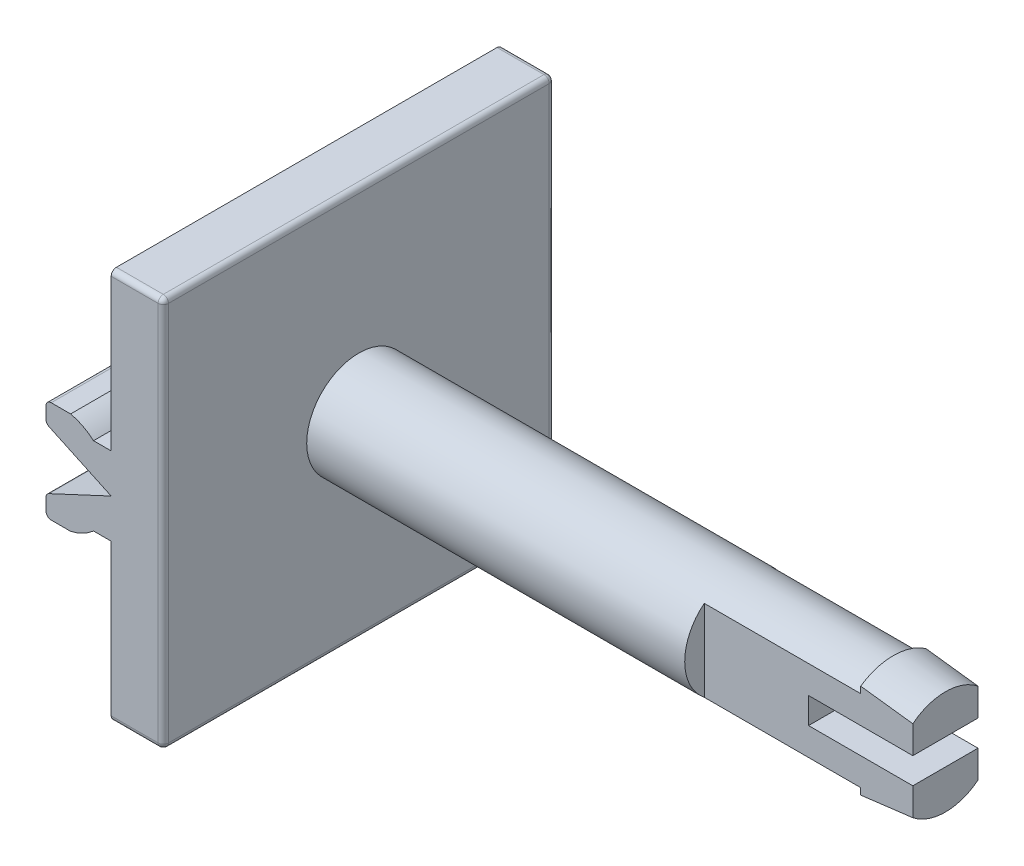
ISO-10303-21;
HEADER;
FILE_DESCRIPTION(('STEP AP214'),'2;1');
FILE_NAME('part.step','',(''),(''),'','','');
FILE_SCHEMA(('AUTOMOTIVE_DESIGN { 1 0 10303 214 1 1 1 1 }'));
ENDSEC;
DATA;
#1=APPLICATION_CONTEXT('core data for automotive mechanical design processes');
#2=APPLICATION_PROTOCOL_DEFINITION('international standard','automotive_design',2000,#1);
#3=PRODUCT_CONTEXT('',#1,'mechanical');
#4=PRODUCT('Part','Part','',(#3));
#5=PRODUCT_RELATED_PRODUCT_CATEGORY('part','',(#4));
#6=PRODUCT_DEFINITION_FORMATION('','',#4);
#7=PRODUCT_DEFINITION_CONTEXT('part definition',#1,'design');
#8=PRODUCT_DEFINITION('design','',#6,#7);
#9=PRODUCT_DEFINITION_SHAPE('','',#8);
#10=(LENGTH_UNIT() NAMED_UNIT(*) SI_UNIT(.MILLI.,.METRE.));
#11=(NAMED_UNIT(*) PLANE_ANGLE_UNIT() SI_UNIT($,.RADIAN.));
#12=(NAMED_UNIT(*) SI_UNIT($,.STERADIAN.) SOLID_ANGLE_UNIT());
#13=UNCERTAINTY_MEASURE_WITH_UNIT(LENGTH_MEASURE(1.E-05),#10,'distance_accuracy_value','');
#14=(GEOMETRIC_REPRESENTATION_CONTEXT(3) GLOBAL_UNCERTAINTY_ASSIGNED_CONTEXT((#13)) GLOBAL_UNIT_ASSIGNED_CONTEXT((#10,
#11,#12)) REPRESENTATION_CONTEXT('',''));
#15=CARTESIAN_POINT('',(0.,0.,0.));
#16=DIRECTION('',(0.,0.,1.));
#17=DIRECTION('',(1.,0.,0.));
#18=AXIS2_PLACEMENT_3D('',#15,#16,#17);
#19=CARTESIAN_POINT('',(24.5,0.,0.));
#20=DIRECTION('',(1.,0.,0.));
#21=DIRECTION('',(0.,0.,-1.));
#22=AXIS2_PLACEMENT_3D('',#19,#20,#21);
#23=PLANE('',#22);
#24=DIRECTION('',(0.,0.,1.));
#25=VECTOR('',#24,1.);
#26=CARTESIAN_POINT('',(24.5,-0.5,-5.37310562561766));
#27=LINE('',#26,#25);
#28=CARTESIAN_POINT('',(24.5,-0.5,-1.25));
#29=VERTEX_POINT('',#28);
#30=CARTESIAN_POINT('',(24.5,-0.5,1.25));
#31=VERTEX_POINT('',#30);
#32=EDGE_CURVE('E777',#29,#31,#27,.T.);
#33=ORIENTED_EDGE('',*,*,#32,.T.);
#34=DIRECTION('',(0.,1.,0.));
#35=VECTOR('',#34,1.);
#36=CARTESIAN_POINT('',(24.5,0.,1.25));
#37=LINE('',#36,#35);
#38=CARTESIAN_POINT('',(24.5,-1.5612494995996,1.25));
#39=VERTEX_POINT('',#38);
#40=EDGE_CURVE('E307',#39,#31,#37,.T.);
#41=ORIENTED_EDGE('',*,*,#40,.F.);
#42=CARTESIAN_POINT('',(24.5,0.,0.));
#43=DIRECTION('',(1.,0.,0.));
#44=DIRECTION('',(0.,0.,-1.));
#45=AXIS2_PLACEMENT_3D('',#42,#43,#44);
#46=CIRCLE('',#45,2.);
#47=CARTESIAN_POINT('',(24.5,-1.5612494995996,-1.25));
#48=VERTEX_POINT('',#47);
#49=EDGE_CURVE('E698',#39,#48,#46,.T.);
#50=ORIENTED_EDGE('',*,*,#49,.T.);
#51=DIRECTION('',(0.,-1.,0.));
#52=VECTOR('',#51,1.);
#53=CARTESIAN_POINT('',(24.5,0.,-1.25));
#54=LINE('',#53,#52);
#55=EDGE_CURVE('E318',#29,#48,#54,.T.);
#56=ORIENTED_EDGE('',*,*,#55,.F.);
#57=EDGE_LOOP('',(#33,#41,#50,#56));
#58=FACE_BOUND('',#57,.T.);
#59=ADVANCED_FACE('F36',(#58),#23,.T.);
#60=CARTESIAN_POINT('',(22.5,0.,0.));
#61=DIRECTION('',(-1.,0.,0.));
#62=DIRECTION('',(0.,0.,1.));
#63=AXIS2_PLACEMENT_3D('',#60,#61,#62);
#64=PLANE('',#63);
#65=DIRECTION('',(0.,1.,0.));
#66=VECTOR('',#65,1.);
#67=CARTESIAN_POINT('',(22.5,0.,-1.25));
#68=LINE('',#67,#66);
#69=CARTESIAN_POINT('',(22.5,-1.81038669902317,-1.25));
#70=VERTEX_POINT('',#69);
#71=CARTESIAN_POINT('',(22.5,-1.5612494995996,-1.25));
#72=VERTEX_POINT('',#71);
#73=EDGE_CURVE('E702',#70,#72,#68,.T.);
#74=ORIENTED_EDGE('',*,*,#73,.F.);
#75=CARTESIAN_POINT('',(22.5,0.,0.));
#76=DIRECTION('',(1.,0.,0.));
#77=DIRECTION('',(0.,0.,-1.));
#78=AXIS2_PLACEMENT_3D('',#75,#76,#77);
#79=CIRCLE('',#78,2.2);
#80=CARTESIAN_POINT('',(22.5,-1.81038669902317,1.25));
#81=VERTEX_POINT('',#80);
#82=EDGE_CURVE('E620',#81,#70,#79,.T.);
#83=ORIENTED_EDGE('',*,*,#82,.F.);
#84=DIRECTION('',(0.,-1.,0.));
#85=VECTOR('',#84,1.);
#86=CARTESIAN_POINT('',(22.5,0.,1.25));
#87=LINE('',#86,#85);
#88=CARTESIAN_POINT('',(22.5,-1.5612494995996,1.25));
#89=VERTEX_POINT('',#88);
#90=EDGE_CURVE('E712',#89,#81,#87,.T.);
#91=ORIENTED_EDGE('',*,*,#90,.F.);
#92=CARTESIAN_POINT('',(22.5,0.,0.));
#93=DIRECTION('',(-1.,0.,0.));
#94=DIRECTION('',(0.,0.,1.));
#95=AXIS2_PLACEMENT_3D('',#92,#93,#94);
#96=CIRCLE('',#95,2.);
#97=EDGE_CURVE('E740',#72,#89,#96,.T.);
#98=ORIENTED_EDGE('',*,*,#97,.F.);
#99=EDGE_LOOP('',(#74,#83,#91,#98));
#100=FACE_BOUND('',#99,.T.);
#101=ADVANCED_FACE('F658',(#100),#64,.T.);
#102=CARTESIAN_POINT('',(24.5,0.,0.));
#103=DIRECTION('',(-1.,0.,0.));
#104=DIRECTION('',(0.,0.,1.));
#105=AXIS2_PLACEMENT_3D('',#102,#103,#104);
#106=CONICAL_SURFACE('',#105,2.,0.099668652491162);
#107=CARTESIAN_POINT('',(26.8879759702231,-1.24069895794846,-1.25));
#108=CARTESIAN_POINT('',(26.6236335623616,-1.27820234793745,-1.25));
#109=CARTESIAN_POINT('',(26.3591794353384,-1.31490661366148,-1.25));
#110=CARTESIAN_POINT('',(25.8300937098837,-1.38699940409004,-1.25));
#111=CARTESIAN_POINT('',(25.5654621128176,-1.42238793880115,-1.25));
#112=CARTESIAN_POINT('',(25.0360693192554,-1.49213155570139,-1.25));
#113=CARTESIAN_POINT('',(24.7713081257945,-1.52648666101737,-1.25));
#114=CARTESIAN_POINT('',(24.2416767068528,-1.59434877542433,-1.25));
#115=CARTESIAN_POINT('',(23.9768064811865,-1.62785578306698,-1.25));
#116=CARTESIAN_POINT('',(23.4787153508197,-1.69019227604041,-1.25));
#117=CARTESIAN_POINT('',(23.245504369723,-1.7191012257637,-1.25));
#118=CARTESIAN_POINT('',(22.3656851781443,-1.8272745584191,-1.25));
#119=CARTESIAN_POINT('',(21.7188858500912,-1.90498629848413,-1.25));
#120=CARTESIAN_POINT('',(20.748474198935,-2.01971728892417,-1.25));
#121=CARTESIAN_POINT('',(20.4249694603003,-2.05765470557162,-1.25));
#122=CARTESIAN_POINT('',(19.7778995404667,-2.13300156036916,-1.25));
#123=CARTESIAN_POINT('',(19.4543343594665,-2.17041100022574,-1.25));
#124=CARTESIAN_POINT('',(19.1307435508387,-2.20759863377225,-1.25));
#125=B_SPLINE_CURVE_WITH_KNOTS('',3,(#107,#108,#109,#110,#111,#112,#113,#114,#115,#116,#117,
#118,#119,#120,#121,#122,#123,#124),.UNSPECIFIED.,.F.,.F.,(4,2,2,2,2,2,2,2,4),(0.,
0.800965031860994,1.60192397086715,2.40286497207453,3.20380734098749,3.90879469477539,
5.86313912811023,6.84030376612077,7.81746524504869),.UNSPECIFIED.);
#126=EDGE_CURVE('E695',#48,#70,#125,.T.);
#127=ORIENTED_EDGE('',*,*,#126,.F.);
#128=ORIENTED_EDGE('',*,*,#49,.F.);
#129=CARTESIAN_POINT('',(19.1307435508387,-2.20759863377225,1.25));
#130=CARTESIAN_POINT('',(19.4543420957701,-2.17041004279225,1.25));
#131=CARTESIAN_POINT('',(19.77791504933,-2.13299973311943,1.25));
#132=CARTESIAN_POINT('',(20.4250003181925,-2.05765113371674,1.25));
#133=CARTESIAN_POINT('',(20.7485126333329,-2.01971284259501,1.25));
#134=CARTESIAN_POINT('',(21.718916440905,-1.90498248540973,1.25));
#135=CARTESIAN_POINT('',(22.3657002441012,-1.82727202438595,1.25));
#136=CARTESIAN_POINT('',(23.335557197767,-1.70802961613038,1.25));
#137=CARTESIAN_POINT('',(23.6587947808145,-1.66783537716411,1.25));
#138=CARTESIAN_POINT('',(24.305128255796,-1.58633058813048,1.25));
#139=CARTESIAN_POINT('',(24.6282241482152,-1.54502004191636,1.25));
#140=CARTESIAN_POINT('',(25.2742474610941,-1.46100179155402,1.25));
#141=CARTESIAN_POINT('',(25.5971748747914,-1.41829403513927,1.25));
#142=CARTESIAN_POINT('',(26.2427809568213,-1.33101293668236,1.25));
#143=CARTESIAN_POINT('',(26.5654596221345,-1.28643957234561,1.25));
#144=CARTESIAN_POINT('',(26.8879759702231,-1.24069895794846,1.25));
#145=B_SPLINE_CURVE_WITH_KNOTS('',3,(#129,#130,#131,#132,#133,#134,#135,#136,#137,#138,#139,
#140,#141,#142,#143,#144),.UNSPECIFIED.,.F.,.F.,(4,2,2,2,2,2,2,4),(0.,0.977184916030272,
1.9543724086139,3.90867055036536,4.88585021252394,5.86302650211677,6.84023938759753,
7.81746395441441),.UNSPECIFIED.);
#146=EDGE_CURVE('E713',#81,#39,#145,.T.);
#147=ORIENTED_EDGE('',*,*,#146,.F.);
#148=ORIENTED_EDGE('',*,*,#82,.T.);
#149=EDGE_LOOP('',(#127,#128,#147,#148));
#150=FACE_BOUND('',#149,.T.);
#151=ADVANCED_FACE('F664',(#150),#106,.T.);
#152=CARTESIAN_POINT('',(2.,0.,0.));
#153=DIRECTION('',(-1.,0.,0.));
#154=DIRECTION('',(0.,0.,1.));
#155=AXIS2_PLACEMENT_3D('',#152,#153,#154);
#156=PLANE('',#155);
#157=DIRECTION('',(0.,-1.,0.));
#158=VECTOR('',#157,1.);
#159=CARTESIAN_POINT('',(2.,0.,7.3));
#160=LINE('',#159,#158);
#161=CARTESIAN_POINT('',(2.,7.3,7.3));
#162=VERTEX_POINT('',#161);
#163=CARTESIAN_POINT('',(2.,-7.3,7.3));
#164=VERTEX_POINT('',#163);
#165=EDGE_CURVE('E517',#162,#164,#160,.T.);
#166=ORIENTED_EDGE('',*,*,#165,.T.);
#167=DIRECTION('',(0.,0.,-1.));
#168=VECTOR('',#167,1.);
#169=CARTESIAN_POINT('',(2.,-7.3,0.));
#170=LINE('',#169,#168);
#171=CARTESIAN_POINT('',(2.,-7.3,-7.3));
#172=VERTEX_POINT('',#171);
#173=EDGE_CURVE('E522',#164,#172,#170,.T.);
#174=ORIENTED_EDGE('',*,*,#173,.T.);
#175=DIRECTION('',(0.,1.,0.));
#176=VECTOR('',#175,1.);
#177=CARTESIAN_POINT('',(2.,0.,-7.3));
#178=LINE('',#177,#176);
#179=CARTESIAN_POINT('',(2.,7.3,-7.3));
#180=VERTEX_POINT('',#179);
#181=EDGE_CURVE('E61',#172,#180,#178,.T.);
#182=ORIENTED_EDGE('',*,*,#181,.T.);
#183=DIRECTION('',(0.,0.,1.));
#184=VECTOR('',#183,1.);
#185=CARTESIAN_POINT('',(2.,7.3,0.));
#186=LINE('',#185,#184);
#187=EDGE_CURVE('E519',#180,#162,#186,.T.);
#188=ORIENTED_EDGE('',*,*,#187,.T.);
#189=EDGE_LOOP('',(#166,#174,#182,#188));
#190=FACE_BOUND('',#189,.T.);
#191=CARTESIAN_POINT('',(2.,0.,0.));
#192=DIRECTION('',(-1.,0.,0.));
#193=DIRECTION('',(0.,0.,1.));
#194=AXIS2_PLACEMENT_3D('',#191,#192,#193);
#195=CIRCLE('',#194,2.);
#196=CARTESIAN_POINT('',(2.,0.,2.));
#197=VERTEX_POINT('',#196);
#198=EDGE_CURVE('E308',#197,#197,#195,.F.);
#199=ORIENTED_EDGE('',*,*,#198,.F.);
#200=EDGE_LOOP('',(#199));
#201=FACE_BOUND('',#200,.T.);
#202=ADVANCED_FACE('F590',(#190,#201),#156,.F.);
#203=CARTESIAN_POINT('',(0.,0.,0.));
#204=DIRECTION('',(-1.,0.,0.));
#205=DIRECTION('',(0.,0.,1.));
#206=AXIS2_PLACEMENT_3D('',#203,#204,#205);
#207=PLANE('',#206);
#208=DIRECTION('',(0.,0.,1.));
#209=VECTOR('',#208,1.);
#210=CARTESIAN_POINT('',(0.,7.5,-7.5));
#211=LINE('',#210,#209);
#212=CARTESIAN_POINT('',(0.,7.5,-7.3));
#213=VERTEX_POINT('',#212);
#214=CARTESIAN_POINT('',(0.,7.5,7.3));
#215=VERTEX_POINT('',#214);
#216=EDGE_CURVE('E312',#213,#215,#211,.T.);
#217=ORIENTED_EDGE('',*,*,#216,.F.);
#218=CARTESIAN_POINT('',(0.,7.3,-7.3));
#219=DIRECTION('',(-1.,0.,0.));
#220=DIRECTION('',(0.,0.,1.));
#221=AXIS2_PLACEMENT_3D('',#218,#219,#220);
#222=CIRCLE('',#221,0.2);
#223=CARTESIAN_POINT('',(0.,7.3,-7.5));
#224=VERTEX_POINT('',#223);
#225=EDGE_CURVE('E573',#213,#224,#222,.T.);
#226=ORIENTED_EDGE('',*,*,#225,.T.);
#227=DIRECTION('',(0.,1.,0.));
#228=VECTOR('',#227,1.);
#229=CARTESIAN_POINT('',(0.,7.5,-7.5));
#230=LINE('',#229,#228);
#231=CARTESIAN_POINT('',(0.,1.5,-7.5));
#232=VERTEX_POINT('',#231);
#233=EDGE_CURVE('E328',#232,#224,#230,.T.);
#234=ORIENTED_EDGE('',*,*,#233,.F.);
#235=DIRECTION('',(0.,0.,-1.));
#236=VECTOR('',#235,1.);
#237=CARTESIAN_POINT('',(0.,1.5,7.5));
#238=LINE('',#237,#236);
#239=CARTESIAN_POINT('',(0.,1.5,7.5));
#240=VERTEX_POINT('',#239);
#241=EDGE_CURVE('E378',#240,#232,#238,.T.);
#242=ORIENTED_EDGE('',*,*,#241,.F.);
#243=DIRECTION('',(0.,-1.,0.));
#244=VECTOR('',#243,1.);
#245=CARTESIAN_POINT('',(0.,7.5,7.5));
#246=LINE('',#245,#244);
#247=CARTESIAN_POINT('',(0.,7.3,7.5));
#248=VERTEX_POINT('',#247);
#249=EDGE_CURVE('E568',#248,#240,#246,.T.);
#250=ORIENTED_EDGE('',*,*,#249,.F.);
#251=CARTESIAN_POINT('',(0.,7.3,7.3));
#252=DIRECTION('',(-1.,0.,0.));
#253=DIRECTION('',(0.,0.,1.));
#254=AXIS2_PLACEMENT_3D('',#251,#252,#253);
#255=CIRCLE('',#254,0.2);
#256=EDGE_CURVE('E502',#248,#215,#255,.T.);
#257=ORIENTED_EDGE('',*,*,#256,.T.);
#258=EDGE_LOOP('',(#217,#226,#234,#242,#250,#257));
#259=FACE_BOUND('',#258,.T.);
#260=ADVANCED_FACE('F607',(#259),#207,.T.);
#261=CARTESIAN_POINT('',(2.,7.5,7.5));
#262=DIRECTION('',(0.,0.,-1.));
#263=DIRECTION('',(0.,1.,0.));
#264=AXIS2_PLACEMENT_3D('',#261,#262,#263);
#265=PLANE('',#264);
#266=DIRECTION('',(0.,-1.,0.));
#267=VECTOR('',#266,1.);
#268=CARTESIAN_POINT('',(-2.5,0.,7.5));
#269=LINE('',#268,#267);
#270=CARTESIAN_POINT('',(-2.5,-1.293183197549,7.5));
#271=VERTEX_POINT('',#270);
#272=CARTESIAN_POINT('',(-2.5,-1.75,7.5));
#273=VERTEX_POINT('',#272);
#274=EDGE_CURVE('E390',#271,#273,#269,.T.);
#275=ORIENTED_EDGE('',*,*,#274,.T.);
#276=CARTESIAN_POINT('',(-2.3,-1.75,7.5));
#277=DIRECTION('',(0.,0.,-1.));
#278=DIRECTION('',(0.,1.,0.));
#279=AXIS2_PLACEMENT_3D('',#276,#277,#278);
#280=CIRCLE('',#279,0.2);
#281=CARTESIAN_POINT('',(-2.3,-1.95,7.5));
#282=VERTEX_POINT('',#281);
#283=EDGE_CURVE('E515',#273,#282,#280,.F.);
#284=ORIENTED_EDGE('',*,*,#283,.T.);
#285=DIRECTION('',(-1.,0.,0.));
#286=VECTOR('',#285,1.);
#287=CARTESIAN_POINT('',(0.,-1.95,7.5));
#288=LINE('',#287,#286);
#289=CARTESIAN_POINT('',(-1.55559027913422,-1.95,7.5));
#290=VERTEX_POINT('',#289);
#291=EDGE_CURVE('E393',#290,#282,#288,.T.);
#292=ORIENTED_EDGE('',*,*,#291,.F.);
#293=CARTESIAN_POINT('',(-2.,0.,7.5));
#294=DIRECTION('',(0.,0.,1.));
#295=DIRECTION('',(1.,0.,0.));
#296=AXIS2_PLACEMENT_3D('',#293,#294,#295);
#297=CIRCLE('',#296,2.);
#298=CARTESIAN_POINT('',(-0.677124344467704,-1.5,7.5));
#299=VERTEX_POINT('',#298);
#300=EDGE_CURVE('E364',#299,#290,#297,.F.);
#301=ORIENTED_EDGE('',*,*,#300,.F.);
#302=DIRECTION('',(-1.,0.,0.));
#303=VECTOR('',#302,1.);
#304=CARTESIAN_POINT('',(0.,-1.5,7.5));
#305=LINE('',#304,#303);
#306=CARTESIAN_POINT('',(0.,-1.5,7.5));
#307=VERTEX_POINT('',#306);
#308=EDGE_CURVE('E389',#307,#299,#305,.T.);
#309=ORIENTED_EDGE('',*,*,#308,.F.);
#310=CARTESIAN_POINT('',(0.,-7.3,7.5));
#311=VERTEX_POINT('',#310);
#312=EDGE_CURVE('E411',#307,#311,#246,.T.);
#313=ORIENTED_EDGE('',*,*,#312,.T.);
#314=DIRECTION('',(-1.,0.,0.));
#315=VECTOR('',#314,1.);
#316=CARTESIAN_POINT('',(2.,-7.3,7.5));
#317=LINE('',#316,#315);
#318=CARTESIAN_POINT('',(1.8,-7.3,7.5));
#319=VERTEX_POINT('',#318);
#320=EDGE_CURVE('E505',#311,#319,#317,.F.);
#321=ORIENTED_EDGE('',*,*,#320,.T.);
#322=DIRECTION('',(0.,-1.,0.));
#323=VECTOR('',#322,1.);
#324=CARTESIAN_POINT('',(1.8,7.5,7.5));
#325=LINE('',#324,#323);
#326=CARTESIAN_POINT('',(1.8,7.3,7.5));
#327=VERTEX_POINT('',#326);
#328=EDGE_CURVE('E509',#319,#327,#325,.F.);
#329=ORIENTED_EDGE('',*,*,#328,.T.);
#330=DIRECTION('',(-1.,0.,0.));
#331=VECTOR('',#330,1.);
#332=CARTESIAN_POINT('',(2.,7.3,7.5));
#333=LINE('',#332,#331);
#334=EDGE_CURVE('E501',#327,#248,#333,.T.);
#335=ORIENTED_EDGE('',*,*,#334,.T.);
#336=ORIENTED_EDGE('',*,*,#249,.T.);
#337=DIRECTION('',(-1.,0.,0.));
#338=VECTOR('',#337,1.);
#339=CARTESIAN_POINT('',(0.,1.5,7.5));
#340=LINE('',#339,#338);
#341=CARTESIAN_POINT('',(-0.677124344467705,1.5,7.5));
#342=VERTEX_POINT('',#341);
#343=EDGE_CURVE('E345',#240,#342,#340,.T.);
#344=ORIENTED_EDGE('',*,*,#343,.T.);
#345=CARTESIAN_POINT('',(-2.,0.,7.5));
#346=DIRECTION('',(0.,0.,1.));
#347=DIRECTION('',(1.,0.,0.));
#348=AXIS2_PLACEMENT_3D('',#345,#346,#347);
#349=CIRCLE('',#348,2.);
#350=CARTESIAN_POINT('',(-1.55559027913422,1.95,7.5));
#351=VERTEX_POINT('',#350);
#352=EDGE_CURVE('E367',#342,#351,#349,.T.);
#353=ORIENTED_EDGE('',*,*,#352,.T.);
#354=DIRECTION('',(-1.,0.,0.));
#355=VECTOR('',#354,1.);
#356=CARTESIAN_POINT('',(0.,1.95,7.5));
#357=LINE('',#356,#355);
#358=CARTESIAN_POINT('',(-2.3,1.95,7.5));
#359=VERTEX_POINT('',#358);
#360=EDGE_CURVE('E358',#351,#359,#357,.T.);
#361=ORIENTED_EDGE('',*,*,#360,.T.);
#362=CARTESIAN_POINT('',(-2.3,1.75,7.5));
#363=DIRECTION('',(0.,0.,-1.));
#364=DIRECTION('',(0.,1.,0.));
#365=AXIS2_PLACEMENT_3D('',#362,#363,#364);
#366=CIRCLE('',#365,0.2);
#367=CARTESIAN_POINT('',(-2.5,1.75,7.5));
#368=VERTEX_POINT('',#367);
#369=EDGE_CURVE('E504',#359,#368,#366,.F.);
#370=ORIENTED_EDGE('',*,*,#369,.T.);
#371=DIRECTION('',(0.,1.,0.));
#372=VECTOR('',#371,1.);
#373=CARTESIAN_POINT('',(-2.5,0.,7.5));
#374=LINE('',#373,#372);
#375=CARTESIAN_POINT('',(-2.5,1.293183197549,7.5));
#376=VERTEX_POINT('',#375);
#377=EDGE_CURVE('E351',#376,#368,#374,.T.);
#378=ORIENTED_EDGE('',*,*,#377,.F.);
#379=CARTESIAN_POINT('',(-2.3,1.293183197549,7.5));
#380=DIRECTION('',(0.,0.,-1.));
#381=DIRECTION('',(0.,1.,0.));
#382=AXIS2_PLACEMENT_3D('',#379,#380,#381);
#383=CIRCLE('',#382,0.2);
#384=CARTESIAN_POINT('',(-2.38452365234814,1.11192164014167,7.5));
#385=VERTEX_POINT('',#384);
#386=EDGE_CURVE('E507',#376,#385,#383,.F.);
#387=ORIENTED_EDGE('',*,*,#386,.T.);
#388=DIRECTION('',(-0.90630778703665,0.4226182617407,0.));
#389=VECTOR('',#388,1.);
#390=CARTESIAN_POINT('',(0.,0.,7.5));
#391=LINE('',#390,#389);
#392=CARTESIAN_POINT('',(0.,0.,7.5));
#393=VERTEX_POINT('',#392);
#394=EDGE_CURVE('E346',#393,#385,#391,.T.);
#395=ORIENTED_EDGE('',*,*,#394,.F.);
#396=DIRECTION('',(-0.90630778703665,-0.4226182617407,0.));
#397=VECTOR('',#396,1.);
#398=CARTESIAN_POINT('',(0.,0.,7.5));
#399=LINE('',#398,#397);
#400=CARTESIAN_POINT('',(-2.38452365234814,-1.11192164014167,7.5));
#401=VERTEX_POINT('',#400);
#402=EDGE_CURVE('E394',#393,#401,#399,.T.);
#403=ORIENTED_EDGE('',*,*,#402,.T.);
#404=CARTESIAN_POINT('',(-2.3,-1.293183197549,7.5));
#405=DIRECTION('',(0.,0.,-1.));
#406=DIRECTION('',(0.,1.,0.));
#407=AXIS2_PLACEMENT_3D('',#404,#405,#406);
#408=CIRCLE('',#407,0.2);
#409=EDGE_CURVE('E443',#401,#271,#408,.F.);
#410=ORIENTED_EDGE('',*,*,#409,.T.);
#411=EDGE_LOOP('',(#275,#284,#292,#301,#309,#313,#321,#329,#335,#336,#344,#353,#361,#370,#378,
#387,#395,#403,#410));
#412=FACE_BOUND('',#411,.T.);
#413=ADVANCED_FACE('F533',(#412),#265,.F.);
#414=CARTESIAN_POINT('',(2.,-7.5,-7.5));
#415=DIRECTION('',(0.,1.,0.));
#416=DIRECTION('',(0.,0.,1.));
#417=AXIS2_PLACEMENT_3D('',#414,#415,#416);
#418=PLANE('',#417);
#419=DIRECTION('',(0.,0.,-1.));
#420=VECTOR('',#419,1.);
#421=CARTESIAN_POINT('',(0.,-7.5,-7.5));
#422=LINE('',#421,#420);
#423=CARTESIAN_POINT('',(0.,-7.5,7.3));
#424=VERTEX_POINT('',#423);
#425=CARTESIAN_POINT('',(0.,-7.5,-7.3));
#426=VERTEX_POINT('',#425);
#427=EDGE_CURVE('E333',#424,#426,#422,.T.);
#428=ORIENTED_EDGE('',*,*,#427,.T.);
#429=DIRECTION('',(-1.,0.,0.));
#430=VECTOR('',#429,1.);
#431=CARTESIAN_POINT('',(2.,-7.5,-7.3));
#432=LINE('',#431,#430);
#433=CARTESIAN_POINT('',(1.8,-7.5,-7.3));
#434=VERTEX_POINT('',#433);
#435=EDGE_CURVE('E561',#426,#434,#432,.F.);
#436=ORIENTED_EDGE('',*,*,#435,.T.);
#437=DIRECTION('',(0.,0.,-1.));
#438=VECTOR('',#437,1.);
#439=CARTESIAN_POINT('',(1.8,-7.5,-7.5));
#440=LINE('',#439,#438);
#441=CARTESIAN_POINT('',(1.8,-7.5,7.3));
#442=VERTEX_POINT('',#441);
#443=EDGE_CURVE('E557',#434,#442,#440,.F.);
#444=ORIENTED_EDGE('',*,*,#443,.T.);
#445=DIRECTION('',(-1.,0.,0.));
#446=VECTOR('',#445,1.);
#447=CARTESIAN_POINT('',(2.,-7.5,7.3));
#448=LINE('',#447,#446);
#449=EDGE_CURVE('E559',#442,#424,#448,.T.);
#450=ORIENTED_EDGE('',*,*,#449,.T.);
#451=EDGE_LOOP('',(#428,#436,#444,#450));
#452=FACE_BOUND('',#451,.T.);
#453=ADVANCED_FACE('F1012',(#452),#418,.F.);
#454=CARTESIAN_POINT('',(2.,7.5,-7.5));
#455=DIRECTION('',(0.,0.,1.));
#456=DIRECTION('',(0.,-1.,0.));
#457=AXIS2_PLACEMENT_3D('',#454,#455,#456);
#458=PLANE('',#457);
#459=DIRECTION('',(0.,1.,0.));
#460=VECTOR('',#459,1.);
#461=CARTESIAN_POINT('',(1.8,7.5,-7.5));
#462=LINE('',#461,#460);
#463=CARTESIAN_POINT('',(1.8,7.3,-7.5));
#464=VERTEX_POINT('',#463);
#465=CARTESIAN_POINT('',(1.8,-7.3,-7.5));
#466=VERTEX_POINT('',#465);
#467=EDGE_CURVE('E542',#464,#466,#462,.F.);
#468=ORIENTED_EDGE('',*,*,#467,.T.);
#469=DIRECTION('',(-1.,0.,0.));
#470=VECTOR('',#469,1.);
#471=CARTESIAN_POINT('',(2.,-7.3,-7.5));
#472=LINE('',#471,#470);
#473=CARTESIAN_POINT('',(0.,-7.29999999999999,-7.5));
#474=VERTEX_POINT('',#473);
#475=EDGE_CURVE('E550',#466,#474,#472,.T.);
#476=ORIENTED_EDGE('',*,*,#475,.T.);
#477=CARTESIAN_POINT('',(0.,-1.5,-7.5));
#478=VERTEX_POINT('',#477);
#479=EDGE_CURVE('E325',#474,#478,#230,.T.);
#480=ORIENTED_EDGE('',*,*,#479,.T.);
#481=DIRECTION('',(-1.,0.,0.));
#482=VECTOR('',#481,1.);
#483=CARTESIAN_POINT('',(0.,-1.5,-7.5));
#484=LINE('',#483,#482);
#485=CARTESIAN_POINT('',(-0.677124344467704,-1.5,-7.5));
#486=VERTEX_POINT('',#485);
#487=EDGE_CURVE('E400',#478,#486,#484,.T.);
#488=ORIENTED_EDGE('',*,*,#487,.T.);
#489=CARTESIAN_POINT('',(-2.,0.,-7.5));
#490=DIRECTION('',(0.,0.,1.));
#491=DIRECTION('',(1.,0.,0.));
#492=AXIS2_PLACEMENT_3D('',#489,#490,#491);
#493=CIRCLE('',#492,2.);
#494=CARTESIAN_POINT('',(-1.55559027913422,-1.95,-7.5));
#495=VERTEX_POINT('',#494);
#496=EDGE_CURVE('E397',#486,#495,#493,.F.);
#497=ORIENTED_EDGE('',*,*,#496,.T.);
#498=DIRECTION('',(-1.,0.,0.));
#499=VECTOR('',#498,1.);
#500=CARTESIAN_POINT('',(0.,-1.95,-7.5));
#501=LINE('',#500,#499);
#502=CARTESIAN_POINT('',(-2.3,-1.95,-7.5));
#503=VERTEX_POINT('',#502);
#504=EDGE_CURVE('E404',#495,#503,#501,.T.);
#505=ORIENTED_EDGE('',*,*,#504,.T.);
#506=CARTESIAN_POINT('',(-2.3,-1.75,-7.5));
#507=DIRECTION('',(0.,0.,1.));
#508=DIRECTION('',(0.,-1.,0.));
#509=AXIS2_PLACEMENT_3D('',#506,#507,#508);
#510=CIRCLE('',#509,0.2);
#511=CARTESIAN_POINT('',(-2.5,-1.75,-7.5));
#512=VERTEX_POINT('',#511);
#513=EDGE_CURVE('E541',#503,#512,#510,.F.);
#514=ORIENTED_EDGE('',*,*,#513,.T.);
#515=DIRECTION('',(0.,-1.,0.));
#516=VECTOR('',#515,1.);
#517=CARTESIAN_POINT('',(-2.5,0.,-7.5));
#518=LINE('',#517,#516);
#519=CARTESIAN_POINT('',(-2.5,-1.293183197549,-7.5));
#520=VERTEX_POINT('',#519);
#521=EDGE_CURVE('E401',#520,#512,#518,.T.);
#522=ORIENTED_EDGE('',*,*,#521,.F.);
#523=CARTESIAN_POINT('',(-2.3,-1.293183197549,-7.5));
#524=DIRECTION('',(0.,0.,1.));
#525=DIRECTION('',(0.,-1.,0.));
#526=AXIS2_PLACEMENT_3D('',#523,#524,#525);
#527=CIRCLE('',#526,0.2);
#528=CARTESIAN_POINT('',(-2.38452365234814,-1.11192164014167,-7.5));
#529=VERTEX_POINT('',#528);
#530=EDGE_CURVE('E442',#520,#529,#527,.F.);
#531=ORIENTED_EDGE('',*,*,#530,.T.);
#532=DIRECTION('',(-0.90630778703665,-0.4226182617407,0.));
#533=VECTOR('',#532,1.);
#534=CARTESIAN_POINT('',(0.,0.,-7.5));
#535=LINE('',#534,#533);
#536=CARTESIAN_POINT('',(0.,0.,-7.5));
#537=VERTEX_POINT('',#536);
#538=EDGE_CURVE('E405',#537,#529,#535,.T.);
#539=ORIENTED_EDGE('',*,*,#538,.F.);
#540=DIRECTION('',(-0.90630778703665,0.4226182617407,0.));
#541=VECTOR('',#540,1.);
#542=CARTESIAN_POINT('',(0.,0.,-7.5));
#543=LINE('',#542,#541);
#544=CARTESIAN_POINT('',(-2.38452365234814,1.11192164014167,-7.5));
#545=VERTEX_POINT('',#544);
#546=EDGE_CURVE('E354',#537,#545,#543,.T.);
#547=ORIENTED_EDGE('',*,*,#546,.T.);
#548=CARTESIAN_POINT('',(-2.3,1.293183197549,-7.5));
#549=DIRECTION('',(0.,0.,1.));
#550=DIRECTION('',(0.,-1.,0.));
#551=AXIS2_PLACEMENT_3D('',#548,#549,#550);
#552=CIRCLE('',#551,0.2);
#553=CARTESIAN_POINT('',(-2.5,1.293183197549,-7.5));
#554=VERTEX_POINT('',#553);
#555=EDGE_CURVE('E546',#545,#554,#552,.F.);
#556=ORIENTED_EDGE('',*,*,#555,.T.);
#557=DIRECTION('',(0.,1.,0.));
#558=VECTOR('',#557,1.);
#559=CARTESIAN_POINT('',(-2.5,0.,-7.5));
#560=LINE('',#559,#558);
#561=CARTESIAN_POINT('',(-2.5,1.75,-7.5));
#562=VERTEX_POINT('',#561);
#563=EDGE_CURVE('E357',#554,#562,#560,.T.);
#564=ORIENTED_EDGE('',*,*,#563,.T.);
#565=CARTESIAN_POINT('',(-2.3,1.75,-7.5));
#566=DIRECTION('',(0.,0.,1.));
#567=DIRECTION('',(0.,-1.,0.));
#568=AXIS2_PLACEMENT_3D('',#565,#566,#567);
#569=CIRCLE('',#568,0.2);
#570=CARTESIAN_POINT('',(-2.3,1.95,-7.5));
#571=VERTEX_POINT('',#570);
#572=EDGE_CURVE('E324',#562,#571,#569,.F.);
#573=ORIENTED_EDGE('',*,*,#572,.T.);
#574=DIRECTION('',(-1.,0.,0.));
#575=VECTOR('',#574,1.);
#576=CARTESIAN_POINT('',(0.,1.95,-7.5));
#577=LINE('',#576,#575);
#578=CARTESIAN_POINT('',(-1.55559027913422,1.95,-7.5));
#579=VERTEX_POINT('',#578);
#580=EDGE_CURVE('E377',#579,#571,#577,.T.);
#581=ORIENTED_EDGE('',*,*,#580,.F.);
#582=CARTESIAN_POINT('',(-2.,0.,-7.5));
#583=DIRECTION('',(0.,0.,1.));
#584=DIRECTION('',(1.,0.,0.));
#585=AXIS2_PLACEMENT_3D('',#582,#583,#584);
#586=CIRCLE('',#585,2.);
#587=CARTESIAN_POINT('',(-0.677124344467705,1.5,-7.5));
#588=VERTEX_POINT('',#587);
#589=EDGE_CURVE('E384',#588,#579,#586,.T.);
#590=ORIENTED_EDGE('',*,*,#589,.F.);
#591=DIRECTION('',(-1.,0.,0.));
#592=VECTOR('',#591,1.);
#593=CARTESIAN_POINT('',(0.,1.5,-7.5));
#594=LINE('',#593,#592);
#595=EDGE_CURVE('E381',#232,#588,#594,.T.);
#596=ORIENTED_EDGE('',*,*,#595,.F.);
#597=ORIENTED_EDGE('',*,*,#233,.T.);
#598=DIRECTION('',(-1.,0.,0.));
#599=VECTOR('',#598,1.);
#600=CARTESIAN_POINT('',(2.,7.3,-7.5));
#601=LINE('',#600,#599);
#602=EDGE_CURVE('E544',#224,#464,#601,.F.);
#603=ORIENTED_EDGE('',*,*,#602,.T.);
#604=EDGE_LOOP('',(#468,#476,#480,#488,#497,#505,#514,#522,#531,#539,#547,#556,#564,#573,#581,
#590,#596,#597,#603));
#605=FACE_BOUND('',#604,.T.);
#606=ADVANCED_FACE('F610',(#605),#458,.F.);
#607=CARTESIAN_POINT('',(2.,7.5,-7.5));
#608=DIRECTION('',(0.,-1.,0.));
#609=DIRECTION('',(0.,0.,-1.));
#610=AXIS2_PLACEMENT_3D('',#607,#608,#609);
#611=PLANE('',#610);
#612=DIRECTION('',(0.,0.,1.));
#613=VECTOR('',#612,1.);
#614=CARTESIAN_POINT('',(1.8,7.5,-7.5));
#615=LINE('',#614,#613);
#616=CARTESIAN_POINT('',(1.8,7.5,7.3));
#617=VERTEX_POINT('',#616);
#618=CARTESIAN_POINT('',(1.8,7.5,-7.3));
#619=VERTEX_POINT('',#618);
#620=EDGE_CURVE('E563',#617,#619,#615,.F.);
#621=ORIENTED_EDGE('',*,*,#620,.T.);
#622=DIRECTION('',(-1.,0.,0.));
#623=VECTOR('',#622,1.);
#624=CARTESIAN_POINT('',(2.,7.5,-7.3));
#625=LINE('',#624,#623);
#626=EDGE_CURVE('E566',#619,#213,#625,.T.);
#627=ORIENTED_EDGE('',*,*,#626,.T.);
#628=ORIENTED_EDGE('',*,*,#216,.T.);
#629=DIRECTION('',(-1.,0.,0.));
#630=VECTOR('',#629,1.);
#631=CARTESIAN_POINT('',(2.,7.5,7.3));
#632=LINE('',#631,#630);
#633=EDGE_CURVE('E500',#215,#617,#632,.F.);
#634=ORIENTED_EDGE('',*,*,#633,.T.);
#635=EDGE_LOOP('',(#621,#627,#628,#634));
#636=FACE_BOUND('',#635,.T.);
#637=ADVANCED_FACE('F597',(#636),#611,.F.);
#638=ORIENTED_EDGE('',*,*,#479,.F.);
#639=CARTESIAN_POINT('',(0.,-7.3,-7.3));
#640=DIRECTION('',(-1.,0.,0.));
#641=DIRECTION('',(0.,0.,1.));
#642=AXIS2_PLACEMENT_3D('',#639,#640,#641);
#643=CIRCLE('',#642,0.2);
#644=EDGE_CURVE('E555',#474,#426,#643,.T.);
#645=ORIENTED_EDGE('',*,*,#644,.T.);
#646=ORIENTED_EDGE('',*,*,#427,.F.);
#647=CARTESIAN_POINT('',(0.,-7.3,7.3));
#648=DIRECTION('',(-1.,0.,0.));
#649=DIRECTION('',(0.,0.,1.));
#650=AXIS2_PLACEMENT_3D('',#647,#648,#649);
#651=CIRCLE('',#650,0.2);
#652=EDGE_CURVE('E553',#424,#311,#651,.T.);
#653=ORIENTED_EDGE('',*,*,#652,.T.);
#654=ORIENTED_EDGE('',*,*,#312,.F.);
#655=DIRECTION('',(0.,0.,1.));
#656=VECTOR('',#655,1.);
#657=CARTESIAN_POINT('',(0.,-1.5,-7.5));
#658=LINE('',#657,#656);
#659=EDGE_CURVE('E412',#478,#307,#658,.T.);
#660=ORIENTED_EDGE('',*,*,#659,.F.);
#661=EDGE_LOOP('',(#638,#645,#646,#653,#654,#660));
#662=FACE_BOUND('',#661,.T.);
#663=ADVANCED_FACE('F988',(#662),#207,.T.);
#664=CARTESIAN_POINT('',(-2.,0.,-7.5));
#665=DIRECTION('',(0.,0.,1.));
#666=DIRECTION('',(1.,0.,0.));
#667=AXIS2_PLACEMENT_3D('',#664,#665,#666);
#668=CYLINDRICAL_SURFACE('',#667,2.);
#669=ORIENTED_EDGE('',*,*,#300,.T.);
#670=DIRECTION('',(0.,0.,1.));
#671=VECTOR('',#670,1.);
#672=CARTESIAN_POINT('',(-1.55559027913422,-1.95,-7.5));
#673=LINE('',#672,#671);
#674=EDGE_CURVE('E409',#495,#290,#673,.T.);
#675=ORIENTED_EDGE('',*,*,#674,.F.);
#676=ORIENTED_EDGE('',*,*,#496,.F.);
#677=DIRECTION('',(0.,0.,1.));
#678=VECTOR('',#677,1.);
#679=CARTESIAN_POINT('',(-0.677124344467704,-1.5,-7.5));
#680=LINE('',#679,#678);
#681=EDGE_CURVE('E408',#486,#299,#680,.T.);
#682=ORIENTED_EDGE('',*,*,#681,.T.);
#683=EDGE_LOOP('',(#669,#675,#676,#682));
#684=FACE_BOUND('',#683,.T.);
#685=ADVANCED_FACE('F981',(#684),#668,.T.);
#686=CARTESIAN_POINT('',(0.,-1.95,-7.5));
#687=DIRECTION('',(0.,1.,0.));
#688=DIRECTION('',(-1.,0.,0.));
#689=AXIS2_PLACEMENT_3D('',#686,#687,#688);
#690=PLANE('',#689);
#691=ORIENTED_EDGE('',*,*,#291,.T.);
#692=DIRECTION('',(0.,0.,1.));
#693=VECTOR('',#692,1.);
#694=CARTESIAN_POINT('',(-2.3,-1.95,-7.5));
#695=LINE('',#694,#693);
#696=EDGE_CURVE('E445',#282,#503,#695,.F.);
#697=ORIENTED_EDGE('',*,*,#696,.T.);
#698=ORIENTED_EDGE('',*,*,#504,.F.);
#699=ORIENTED_EDGE('',*,*,#674,.T.);
#700=EDGE_LOOP('',(#691,#697,#698,#699));
#701=FACE_BOUND('',#700,.T.);
#702=ADVANCED_FACE('F538',(#701),#690,.F.);
#703=CARTESIAN_POINT('',(-2.5,0.,-7.5));
#704=DIRECTION('',(-1.,0.,0.));
#705=DIRECTION('',(0.,-1.,0.));
#706=AXIS2_PLACEMENT_3D('',#703,#704,#705);
#707=PLANE('',#706);
#708=ORIENTED_EDGE('',*,*,#521,.T.);
#709=DIRECTION('',(0.,0.,1.));
#710=VECTOR('',#709,1.);
#711=CARTESIAN_POINT('',(-2.5,-1.75,7.5));
#712=LINE('',#711,#710);
#713=EDGE_CURVE('E450',#512,#273,#712,.T.);
#714=ORIENTED_EDGE('',*,*,#713,.T.);
#715=ORIENTED_EDGE('',*,*,#274,.F.);
#716=DIRECTION('',(0.,0.,1.));
#717=VECTOR('',#716,1.);
#718=CARTESIAN_POINT('',(-2.5,-1.293183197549,-7.5));
#719=LINE('',#718,#717);
#720=EDGE_CURVE('E524',#271,#520,#719,.F.);
#721=ORIENTED_EDGE('',*,*,#720,.T.);
#722=EDGE_LOOP('',(#708,#714,#715,#721));
#723=FACE_BOUND('',#722,.T.);
#724=ADVANCED_FACE('F529',(#723),#707,.T.);
#725=CARTESIAN_POINT('',(0.,0.,-7.5));
#726=DIRECTION('',(-0.4226182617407,0.90630778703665,0.));
#727=DIRECTION('',(-0.90630778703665,-0.4226182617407,0.));
#728=AXIS2_PLACEMENT_3D('',#725,#726,#727);
#729=PLANE('',#728);
#730=ORIENTED_EDGE('',*,*,#538,.T.);
#731=DIRECTION('',(0.,0.,1.));
#732=VECTOR('',#731,1.);
#733=CARTESIAN_POINT('',(-2.38452365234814,-1.11192164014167,-7.5));
#734=LINE('',#733,#732);
#735=EDGE_CURVE('E436',#529,#401,#734,.T.);
#736=ORIENTED_EDGE('',*,*,#735,.T.);
#737=ORIENTED_EDGE('',*,*,#402,.F.);
#738=DIRECTION('',(0.,0.,-1.));
#739=VECTOR('',#738,1.);
#740=CARTESIAN_POINT('',(0.,0.,7.5));
#741=LINE('',#740,#739);
#742=EDGE_CURVE('E343',#393,#537,#741,.T.);
#743=ORIENTED_EDGE('',*,*,#742,.T.);
#744=EDGE_LOOP('',(#730,#736,#737,#743));
#745=FACE_BOUND('',#744,.T.);
#746=ADVANCED_FACE('F435',(#745),#729,.T.);
#747=CARTESIAN_POINT('',(0.,-1.5,-7.5));
#748=DIRECTION('',(0.,1.,0.));
#749=DIRECTION('',(0.,0.,1.));
#750=AXIS2_PLACEMENT_3D('',#747,#748,#749);
#751=PLANE('',#750);
#752=ORIENTED_EDGE('',*,*,#308,.T.);
#753=ORIENTED_EDGE('',*,*,#681,.F.);
#754=ORIENTED_EDGE('',*,*,#487,.F.);
#755=ORIENTED_EDGE('',*,*,#659,.T.);
#756=EDGE_LOOP('',(#752,#753,#754,#755));
#757=FACE_BOUND('',#756,.T.);
#758=ADVANCED_FACE('F962',(#757),#751,.F.);
#759=CARTESIAN_POINT('',(0.,1.5,7.5));
#760=DIRECTION('',(0.,-1.,0.));
#761=DIRECTION('',(0.,0.,-1.));
#762=AXIS2_PLACEMENT_3D('',#759,#760,#761);
#763=PLANE('',#762);
#764=ORIENTED_EDGE('',*,*,#241,.T.);
#765=ORIENTED_EDGE('',*,*,#595,.T.);
#766=DIRECTION('',(0.,0.,-1.));
#767=VECTOR('',#766,1.);
#768=CARTESIAN_POINT('',(-0.677124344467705,1.5,7.5));
#769=LINE('',#768,#767);
#770=EDGE_CURVE('E385',#342,#588,#769,.T.);
#771=ORIENTED_EDGE('',*,*,#770,.F.);
#772=ORIENTED_EDGE('',*,*,#343,.F.);
#773=EDGE_LOOP('',(#764,#765,#771,#772));
#774=FACE_BOUND('',#773,.T.);
#775=ADVANCED_FACE('F627',(#774),#763,.F.);
#776=CARTESIAN_POINT('',(-2.,0.,7.5));
#777=DIRECTION('',(0.,0.,-1.));
#778=DIRECTION('',(-1.,0.,0.));
#779=AXIS2_PLACEMENT_3D('',#776,#777,#778);
#780=CYLINDRICAL_SURFACE('',#779,2.);
#781=ORIENTED_EDGE('',*,*,#770,.T.);
#782=ORIENTED_EDGE('',*,*,#589,.T.);
#783=DIRECTION('',(0.,0.,-1.));
#784=VECTOR('',#783,1.);
#785=CARTESIAN_POINT('',(-1.55559027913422,1.95,7.5));
#786=LINE('',#785,#784);
#787=EDGE_CURVE('E382',#351,#579,#786,.T.);
#788=ORIENTED_EDGE('',*,*,#787,.F.);
#789=ORIENTED_EDGE('',*,*,#352,.F.);
#790=EDGE_LOOP('',(#781,#782,#788,#789));
#791=FACE_BOUND('',#790,.T.);
#792=ADVANCED_FACE('F629',(#791),#780,.T.);
#793=CARTESIAN_POINT('',(0.,1.95,7.5));
#794=DIRECTION('',(0.,-1.,0.));
#795=DIRECTION('',(1.,0.,0.));
#796=AXIS2_PLACEMENT_3D('',#793,#794,#795);
#797=PLANE('',#796);
#798=ORIENTED_EDGE('',*,*,#580,.T.);
#799=DIRECTION('',(0.,0.,-1.));
#800=VECTOR('',#799,1.);
#801=CARTESIAN_POINT('',(-2.3,1.95,7.5));
#802=LINE('',#801,#800);
#803=EDGE_CURVE('E11',#571,#359,#802,.F.);
#804=ORIENTED_EDGE('',*,*,#803,.T.);
#805=ORIENTED_EDGE('',*,*,#360,.F.);
#806=ORIENTED_EDGE('',*,*,#787,.T.);
#807=EDGE_LOOP('',(#798,#804,#805,#806));
#808=FACE_BOUND('',#807,.T.);
#809=ADVANCED_FACE('F631',(#808),#797,.F.);
#810=CARTESIAN_POINT('',(-2.5,0.,7.5));
#811=DIRECTION('',(-1.,0.,0.));
#812=DIRECTION('',(0.,0.,1.));
#813=AXIS2_PLACEMENT_3D('',#810,#811,#812);
#814=PLANE('',#813);
#815=ORIENTED_EDGE('',*,*,#563,.F.);
#816=DIRECTION('',(0.,0.,-1.));
#817=VECTOR('',#816,1.);
#818=CARTESIAN_POINT('',(-2.5,1.293183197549,7.5));
#819=LINE('',#818,#817);
#820=EDGE_CURVE('E45',#554,#376,#819,.F.);
#821=ORIENTED_EDGE('',*,*,#820,.T.);
#822=ORIENTED_EDGE('',*,*,#377,.T.);
#823=DIRECTION('',(0.,0.,-1.));
#824=VECTOR('',#823,1.);
#825=CARTESIAN_POINT('',(-2.5,1.75,-7.5));
#826=LINE('',#825,#824);
#827=EDGE_CURVE('E448',#368,#562,#826,.T.);
#828=ORIENTED_EDGE('',*,*,#827,.T.);
#829=EDGE_LOOP('',(#815,#821,#822,#828));
#830=FACE_BOUND('',#829,.T.);
#831=ADVANCED_FACE('F639',(#830),#814,.T.);
#832=CARTESIAN_POINT('',(0.,0.,7.5));
#833=DIRECTION('',(-0.4226182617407,-0.90630778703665,0.));
#834=DIRECTION('',(0.90630778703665,-0.4226182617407,0.));
#835=AXIS2_PLACEMENT_3D('',#832,#833,#834);
#836=PLANE('',#835);
#837=ORIENTED_EDGE('',*,*,#394,.T.);
#838=DIRECTION('',(0.,0.,-1.));
#839=VECTOR('',#838,1.);
#840=CARTESIAN_POINT('',(-2.38452365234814,1.11192164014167,7.5));
#841=LINE('',#840,#839);
#842=EDGE_CURVE('E444',#385,#545,#841,.T.);
#843=ORIENTED_EDGE('',*,*,#842,.T.);
#844=ORIENTED_EDGE('',*,*,#546,.F.);
#845=ORIENTED_EDGE('',*,*,#742,.F.);
#846=EDGE_LOOP('',(#837,#843,#844,#845));
#847=FACE_BOUND('',#846,.T.);
#848=ADVANCED_FACE('F645',(#847),#836,.T.);
#849=CARTESIAN_POINT('',(24.5,0.,0.));
#850=DIRECTION('',(-1.,0.,0.));
#851=DIRECTION('',(0.,0.,1.));
#852=AXIS2_PLACEMENT_3D('',#849,#850,#851);
#853=CYLINDRICAL_SURFACE('',#852,2.);
#854=CARTESIAN_POINT('',(22.5,1.5612494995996,1.25));
#855=VERTEX_POINT('',#854);
#856=CARTESIAN_POINT('',(22.5,1.5612494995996,-1.25));
#857=VERTEX_POINT('',#856);
#858=EDGE_CURVE('E316',#855,#857,#96,.T.);
#859=ORIENTED_EDGE('',*,*,#858,.T.);
#860=DIRECTION('',(-1.,0.,0.));
#861=VECTOR('',#860,1.);
#862=CARTESIAN_POINT('',(24.5,1.5612494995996,-1.25));
#863=LINE('',#862,#861);
#864=CARTESIAN_POINT('',(16.5,1.5612494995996,-1.25));
#865=VERTEX_POINT('',#864);
#866=EDGE_CURVE('E703',#857,#865,#863,.T.);
#867=ORIENTED_EDGE('',*,*,#866,.T.);
#868=CARTESIAN_POINT('',(16.5,0.,0.));
#869=DIRECTION('',(-1.,0.,0.));
#870=DIRECTION('',(0.,0.,1.));
#871=AXIS2_PLACEMENT_3D('',#868,#869,#870);
#872=CIRCLE('',#871,2.);
#873=CARTESIAN_POINT('',(16.5,-1.5612494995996,-1.25));
#874=VERTEX_POINT('',#873);
#875=EDGE_CURVE('E321',#865,#874,#872,.T.);
#876=ORIENTED_EDGE('',*,*,#875,.T.);
#877=DIRECTION('',(-1.,0.,0.));
#878=VECTOR('',#877,1.);
#879=CARTESIAN_POINT('',(24.5,-1.5612494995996,-1.25));
#880=LINE('',#879,#878);
#881=EDGE_CURVE('E755',#874,#72,#880,.F.);
#882=ORIENTED_EDGE('',*,*,#881,.T.);
#883=ORIENTED_EDGE('',*,*,#97,.T.);
#884=DIRECTION('',(-1.,0.,0.));
#885=VECTOR('',#884,1.);
#886=CARTESIAN_POINT('',(24.5,-1.5612494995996,1.25));
#887=LINE('',#886,#885);
#888=CARTESIAN_POINT('',(16.5,-1.5612494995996,1.25));
#889=VERTEX_POINT('',#888);
#890=EDGE_CURVE('E708',#89,#889,#887,.T.);
#891=ORIENTED_EDGE('',*,*,#890,.T.);
#892=CARTESIAN_POINT('',(16.5,0.,0.));
#893=DIRECTION('',(1.,0.,0.));
#894=DIRECTION('',(0.,0.,-1.));
#895=AXIS2_PLACEMENT_3D('',#892,#893,#894);
#896=CIRCLE('',#895,2.);
#897=CARTESIAN_POINT('',(16.5,1.5612494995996,1.25));
#898=VERTEX_POINT('',#897);
#899=EDGE_CURVE('E310',#898,#889,#896,.T.);
#900=ORIENTED_EDGE('',*,*,#899,.F.);
#901=DIRECTION('',(-1.,0.,0.));
#902=VECTOR('',#901,1.);
#903=CARTESIAN_POINT('',(24.5,1.5612494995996,1.25));
#904=LINE('',#903,#902);
#905=EDGE_CURVE('E718',#898,#855,#904,.F.);
#906=ORIENTED_EDGE('',*,*,#905,.T.);
#907=EDGE_LOOP('',(#859,#867,#876,#882,#883,#891,#900,#906));
#908=FACE_BOUND('',#907,.T.);
#909=ORIENTED_EDGE('',*,*,#198,.T.);
#910=EDGE_LOOP('',(#909));
#911=FACE_BOUND('',#910,.T.);
#912=ADVANCED_FACE('F647',(#908,#911),#853,.T.);
#913=CARTESIAN_POINT('',(22.5,1.81038669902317,-1.25));
#914=VERTEX_POINT('',#913);
#915=EDGE_CURVE('E749',#857,#914,#68,.T.);
#916=ORIENTED_EDGE('',*,*,#915,.F.);
#917=ORIENTED_EDGE('',*,*,#858,.F.);
#918=CARTESIAN_POINT('',(22.5,1.81038669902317,1.25));
#919=VERTEX_POINT('',#918);
#920=EDGE_CURVE('E731',#919,#855,#87,.T.);
#921=ORIENTED_EDGE('',*,*,#920,.F.);
#922=EDGE_CURVE('E707',#914,#919,#79,.T.);
#923=ORIENTED_EDGE('',*,*,#922,.F.);
#924=EDGE_LOOP('',(#916,#917,#921,#923));
#925=FACE_BOUND('',#924,.T.);
#926=ADVANCED_FACE('F653',(#925),#64,.T.);
#927=CARTESIAN_POINT('',(19.1307435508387,2.20759863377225,-1.25));
#928=CARTESIAN_POINT('',(19.4543420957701,2.17041004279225,-1.25));
#929=CARTESIAN_POINT('',(19.77791504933,2.13299973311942,-1.25));
#930=CARTESIAN_POINT('',(20.4250003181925,2.05765113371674,-1.25));
#931=CARTESIAN_POINT('',(20.7485126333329,2.01971284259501,-1.25));
#932=CARTESIAN_POINT('',(21.718916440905,1.90498248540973,-1.25));
#933=CARTESIAN_POINT('',(22.3657002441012,1.82727202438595,-1.25));
#934=CARTESIAN_POINT('',(23.335557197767,1.70802961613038,-1.25));
#935=CARTESIAN_POINT('',(23.6587947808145,1.66783537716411,-1.25));
#936=CARTESIAN_POINT('',(24.305128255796,1.58633058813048,-1.25));
#937=CARTESIAN_POINT('',(24.6282241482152,1.54502004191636,-1.25));
#938=CARTESIAN_POINT('',(25.2742474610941,1.46100179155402,-1.25));
#939=CARTESIAN_POINT('',(25.5971748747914,1.41829403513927,-1.25));
#940=CARTESIAN_POINT('',(26.2427809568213,1.33101293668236,-1.25));
#941=CARTESIAN_POINT('',(26.5654596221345,1.28643957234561,-1.25));
#942=CARTESIAN_POINT('',(26.8879759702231,1.24069895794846,-1.25));
#943=B_SPLINE_CURVE_WITH_KNOTS('',3,(#927,#928,#929,#930,#931,#932,#933,#934,#935,#936,#937,
#938,#939,#940,#941,#942),.UNSPECIFIED.,.F.,.F.,(4,2,2,2,2,2,2,4),(0.,0.977184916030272,
1.9543724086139,3.90867055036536,4.88585021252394,5.86302650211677,6.84023938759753,
7.81746395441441),.UNSPECIFIED.);
#944=CARTESIAN_POINT('',(24.5,1.5612494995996,-1.25));
#945=VERTEX_POINT('',#944);
#946=EDGE_CURVE('E750',#914,#945,#943,.T.);
#947=ORIENTED_EDGE('',*,*,#946,.F.);
#948=ORIENTED_EDGE('',*,*,#922,.T.);
#949=CARTESIAN_POINT('',(26.8879759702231,1.24069895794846,1.25));
#950=CARTESIAN_POINT('',(26.6236335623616,1.27820234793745,1.25));
#951=CARTESIAN_POINT('',(26.3591794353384,1.31490661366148,1.25));
#952=CARTESIAN_POINT('',(25.8300937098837,1.38699940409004,1.25));
#953=CARTESIAN_POINT('',(25.5654621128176,1.42238793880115,1.25));
#954=CARTESIAN_POINT('',(25.0360693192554,1.49213155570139,1.25));
#955=CARTESIAN_POINT('',(24.7713081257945,1.52648666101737,1.25));
#956=CARTESIAN_POINT('',(24.2416767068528,1.59434877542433,1.25));
#957=CARTESIAN_POINT('',(23.9768064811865,1.62785578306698,1.25));
#958=CARTESIAN_POINT('',(23.4787153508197,1.69019227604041,1.25));
#959=CARTESIAN_POINT('',(23.245504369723,1.7191012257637,1.25));
#960=CARTESIAN_POINT('',(22.3656851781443,1.8272745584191,1.25));
#961=CARTESIAN_POINT('',(21.7188858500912,1.90498629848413,1.25));
#962=CARTESIAN_POINT('',(20.748474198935,2.01971728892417,1.25));
#963=CARTESIAN_POINT('',(20.4249694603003,2.05765470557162,1.25));
#964=CARTESIAN_POINT('',(19.7778995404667,2.13300156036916,1.25));
#965=CARTESIAN_POINT('',(19.4543343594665,2.17041100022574,1.25));
#966=CARTESIAN_POINT('',(19.1307435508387,2.20759863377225,1.25));
#967=B_SPLINE_CURVE_WITH_KNOTS('',3,(#949,#950,#951,#952,#953,#954,#955,#956,#957,#958,#959,
#960,#961,#962,#963,#964,#965,#966),.UNSPECIFIED.,.F.,.F.,(4,2,2,2,2,2,2,2,4),(0.,
0.800965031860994,1.60192397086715,2.40286497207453,3.20380734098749,3.90879469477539,
5.86313912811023,6.84030376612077,7.81746524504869),.UNSPECIFIED.);
#968=CARTESIAN_POINT('',(24.5,1.5612494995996,1.25));
#969=VERTEX_POINT('',#968);
#970=EDGE_CURVE('E726',#969,#919,#967,.T.);
#971=ORIENTED_EDGE('',*,*,#970,.F.);
#972=EDGE_CURVE('E305',#945,#969,#46,.T.);
#973=ORIENTED_EDGE('',*,*,#972,.F.);
#974=EDGE_LOOP('',(#947,#948,#971,#973));
#975=FACE_BOUND('',#974,.T.);
#976=ADVANCED_FACE('F670',(#975),#106,.T.);
#977=DIRECTION('',(0.,0.,1.));
#978=VECTOR('',#977,1.);
#979=CARTESIAN_POINT('',(24.5,0.5,-5.37310562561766));
#980=LINE('',#979,#978);
#981=CARTESIAN_POINT('',(24.5,0.5,-1.25));
#982=VERTEX_POINT('',#981);
#983=CARTESIAN_POINT('',(24.5,0.5,1.25));
#984=VERTEX_POINT('',#983);
#985=EDGE_CURVE('E279',#982,#984,#980,.T.);
#986=ORIENTED_EDGE('',*,*,#985,.F.);
#987=EDGE_CURVE('E319',#945,#982,#54,.T.);
#988=ORIENTED_EDGE('',*,*,#987,.F.);
#989=ORIENTED_EDGE('',*,*,#972,.T.);
#990=EDGE_CURVE('E297',#984,#969,#37,.T.);
#991=ORIENTED_EDGE('',*,*,#990,.F.);
#992=EDGE_LOOP('',(#986,#988,#989,#991));
#993=FACE_BOUND('',#992,.T.);
#994=ADVANCED_FACE('F303',(#993),#23,.T.);
#995=CARTESIAN_POINT('',(16.5,0.,0.));
#996=DIRECTION('',(1.,0.,0.));
#997=DIRECTION('',(0.,0.,-1.));
#998=AXIS2_PLACEMENT_3D('',#995,#996,#997);
#999=PLANE('',#998);
#1000=ORIENTED_EDGE('',*,*,#899,.T.);
#1001=DIRECTION('',(0.,1.,0.));
#1002=VECTOR('',#1001,1.);
#1003=CARTESIAN_POINT('',(16.5,-2.5,1.25));
#1004=LINE('',#1003,#1002);
#1005=EDGE_CURVE('E732',#889,#898,#1004,.T.);
#1006=ORIENTED_EDGE('',*,*,#1005,.T.);
#1007=EDGE_LOOP('',(#1000,#1006));
#1008=FACE_BOUND('',#1007,.T.);
#1009=ADVANCED_FACE('F669',(#1008),#999,.T.);
#1010=CARTESIAN_POINT('',(16.5,0.,1.25));
#1011=DIRECTION('',(0.,0.,-1.));
#1012=DIRECTION('',(-1.,0.,0.));
#1013=AXIS2_PLACEMENT_3D('',#1010,#1011,#1012);
#1014=PLANE('',#1013);
#1015=ORIENTED_EDGE('',*,*,#40,.T.);
#1016=DIRECTION('',(1.,0.,0.));
#1017=VECTOR('',#1016,1.);
#1018=CARTESIAN_POINT('',(20.5,-0.5,1.25));
#1019=LINE('',#1018,#1017);
#1020=CARTESIAN_POINT('',(20.5,-0.5,1.25));
#1021=VERTEX_POINT('',#1020);
#1022=EDGE_CURVE('E291',#1021,#31,#1019,.T.);
#1023=ORIENTED_EDGE('',*,*,#1022,.F.);
#1024=DIRECTION('',(0.,-1.,0.));
#1025=VECTOR('',#1024,1.);
#1026=CARTESIAN_POINT('',(20.5,0.499999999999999,1.25));
#1027=LINE('',#1026,#1025);
#1028=CARTESIAN_POINT('',(20.5,0.499999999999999,1.25));
#1029=VERTEX_POINT('',#1028);
#1030=EDGE_CURVE('E301',#1029,#1021,#1027,.T.);
#1031=ORIENTED_EDGE('',*,*,#1030,.F.);
#1032=DIRECTION('',(-1.,0.,0.));
#1033=VECTOR('',#1032,1.);
#1034=CARTESIAN_POINT('',(24.5,0.5,1.25));
#1035=LINE('',#1034,#1033);
#1036=EDGE_CURVE('E282',#984,#1029,#1035,.T.);
#1037=ORIENTED_EDGE('',*,*,#1036,.F.);
#1038=ORIENTED_EDGE('',*,*,#990,.T.);
#1039=ORIENTED_EDGE('',*,*,#970,.T.);
#1040=ORIENTED_EDGE('',*,*,#920,.T.);
#1041=ORIENTED_EDGE('',*,*,#905,.F.);
#1042=ORIENTED_EDGE('',*,*,#1005,.F.);
#1043=ORIENTED_EDGE('',*,*,#890,.F.);
#1044=ORIENTED_EDGE('',*,*,#90,.T.);
#1045=ORIENTED_EDGE('',*,*,#146,.T.);
#1046=EDGE_LOOP('',(#1015,#1023,#1031,#1037,#1038,#1039,#1040,#1041,#1042,#1043,#1044,#1045));
#1047=FACE_BOUND('',#1046,.T.);
#1048=ADVANCED_FACE('F295',(#1047),#1014,.F.);
#1049=CARTESIAN_POINT('',(16.5,0.,0.));
#1050=DIRECTION('',(-1.,0.,0.));
#1051=DIRECTION('',(0.,0.,1.));
#1052=AXIS2_PLACEMENT_3D('',#1049,#1050,#1051);
#1053=PLANE('',#1052);
#1054=DIRECTION('',(0.,-1.,0.));
#1055=VECTOR('',#1054,1.);
#1056=CARTESIAN_POINT('',(16.5,-2.5,-1.25));
#1057=LINE('',#1056,#1055);
#1058=EDGE_CURVE('E753',#865,#874,#1057,.T.);
#1059=ORIENTED_EDGE('',*,*,#1058,.T.);
#1060=ORIENTED_EDGE('',*,*,#875,.F.);
#1061=EDGE_LOOP('',(#1059,#1060));
#1062=FACE_BOUND('',#1061,.T.);
#1063=ADVANCED_FACE('F722',(#1062),#1053,.F.);
#1064=CARTESIAN_POINT('',(16.5,0.,-1.25));
#1065=DIRECTION('',(0.,0.,1.));
#1066=DIRECTION('',(1.,0.,0.));
#1067=AXIS2_PLACEMENT_3D('',#1064,#1065,#1066);
#1068=PLANE('',#1067);
#1069=DIRECTION('',(0.,1.,0.));
#1070=VECTOR('',#1069,1.);
#1071=CARTESIAN_POINT('',(20.5,0.499999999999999,-1.25));
#1072=LINE('',#1071,#1070);
#1073=CARTESIAN_POINT('',(20.5,-0.5,-1.25));
#1074=VERTEX_POINT('',#1073);
#1075=CARTESIAN_POINT('',(20.5,0.499999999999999,-1.25));
#1076=VERTEX_POINT('',#1075);
#1077=EDGE_CURVE('E782',#1074,#1076,#1072,.T.);
#1078=ORIENTED_EDGE('',*,*,#1077,.F.);
#1079=DIRECTION('',(-1.,0.,0.));
#1080=VECTOR('',#1079,1.);
#1081=CARTESIAN_POINT('',(20.5,-0.5,-1.25));
#1082=LINE('',#1081,#1080);
#1083=EDGE_CURVE('E772',#29,#1074,#1082,.T.);
#1084=ORIENTED_EDGE('',*,*,#1083,.F.);
#1085=ORIENTED_EDGE('',*,*,#55,.T.);
#1086=ORIENTED_EDGE('',*,*,#126,.T.);
#1087=ORIENTED_EDGE('',*,*,#73,.T.);
#1088=ORIENTED_EDGE('',*,*,#881,.F.);
#1089=ORIENTED_EDGE('',*,*,#1058,.F.);
#1090=ORIENTED_EDGE('',*,*,#866,.F.);
#1091=ORIENTED_EDGE('',*,*,#915,.T.);
#1092=ORIENTED_EDGE('',*,*,#946,.T.);
#1093=ORIENTED_EDGE('',*,*,#987,.T.);
#1094=DIRECTION('',(1.,0.,0.));
#1095=VECTOR('',#1094,1.);
#1096=CARTESIAN_POINT('',(24.5,0.5,-1.25));
#1097=LINE('',#1096,#1095);
#1098=EDGE_CURVE('E285',#1076,#982,#1097,.T.);
#1099=ORIENTED_EDGE('',*,*,#1098,.F.);
#1100=EDGE_LOOP('',(#1078,#1084,#1085,#1086,#1087,#1088,#1089,#1090,#1091,#1092,#1093,#1099));
#1101=FACE_BOUND('',#1100,.T.);
#1102=ADVANCED_FACE('F760',(#1101),#1068,.F.);
#1103=CARTESIAN_POINT('',(20.5,-0.5,-5.37310562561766));
#1104=DIRECTION('',(0.,-1.,0.));
#1105=DIRECTION('',(0.,0.,-1.));
#1106=AXIS2_PLACEMENT_3D('',#1103,#1104,#1105);
#1107=PLANE('',#1106);
#1108=ORIENTED_EDGE('',*,*,#1083,.T.);
#1109=DIRECTION('',(0.,0.,1.));
#1110=VECTOR('',#1109,1.);
#1111=CARTESIAN_POINT('',(20.5,-0.5,-5.37310562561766));
#1112=LINE('',#1111,#1110);
#1113=EDGE_CURVE('E775',#1074,#1021,#1112,.T.);
#1114=ORIENTED_EDGE('',*,*,#1113,.T.);
#1115=ORIENTED_EDGE('',*,*,#1022,.T.);
#1116=ORIENTED_EDGE('',*,*,#32,.F.);
#1117=EDGE_LOOP('',(#1108,#1114,#1115,#1116));
#1118=FACE_BOUND('',#1117,.T.);
#1119=ADVANCED_FACE('F764',(#1118),#1107,.F.);
#1120=CARTESIAN_POINT('',(20.5,0.499999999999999,-5.37310562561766));
#1121=DIRECTION('',(-1.,0.,0.));
#1122=DIRECTION('',(0.,0.,1.));
#1123=AXIS2_PLACEMENT_3D('',#1120,#1121,#1122);
#1124=PLANE('',#1123);
#1125=ORIENTED_EDGE('',*,*,#1077,.T.);
#1126=DIRECTION('',(0.,0.,1.));
#1127=VECTOR('',#1126,1.);
#1128=CARTESIAN_POINT('',(20.5,0.499999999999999,-5.37310562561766));
#1129=LINE('',#1128,#1127);
#1130=EDGE_CURVE('E290',#1076,#1029,#1129,.T.);
#1131=ORIENTED_EDGE('',*,*,#1130,.T.);
#1132=ORIENTED_EDGE('',*,*,#1030,.T.);
#1133=ORIENTED_EDGE('',*,*,#1113,.F.);
#1134=EDGE_LOOP('',(#1125,#1131,#1132,#1133));
#1135=FACE_BOUND('',#1134,.T.);
#1136=ADVANCED_FACE('F788',(#1135),#1124,.F.);
#1137=CARTESIAN_POINT('',(24.5,0.5,-5.37310562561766));
#1138=DIRECTION('',(0.,1.,0.));
#1139=DIRECTION('',(-1.,0.,0.));
#1140=AXIS2_PLACEMENT_3D('',#1137,#1138,#1139);
#1141=PLANE('',#1140);
#1142=ORIENTED_EDGE('',*,*,#1098,.T.);
#1143=ORIENTED_EDGE('',*,*,#985,.T.);
#1144=ORIENTED_EDGE('',*,*,#1036,.T.);
#1145=ORIENTED_EDGE('',*,*,#1130,.F.);
#1146=EDGE_LOOP('',(#1142,#1143,#1144,#1145));
#1147=FACE_BOUND('',#1146,.T.);
#1148=ADVANCED_FACE('F281',(#1147),#1141,.F.);
#1149=CARTESIAN_POINT('',(2.,7.3,7.3));
#1150=DIRECTION('',(-1.,0.,0.));
#1151=DIRECTION('',(0.,0.,1.));
#1152=AXIS2_PLACEMENT_3D('',#1149,#1150,#1151);
#1153=CYLINDRICAL_SURFACE('',#1152,0.2);
#1154=CARTESIAN_POINT('',(1.8,7.3,7.3));
#1155=DIRECTION('',(1.,0.,0.));
#1156=DIRECTION('',(0.,0.,-1.));
#1157=AXIS2_PLACEMENT_3D('',#1154,#1155,#1156);
#1158=CIRCLE('',#1157,0.2);
#1159=EDGE_CURVE('E40',#617,#327,#1158,.T.);
#1160=ORIENTED_EDGE('',*,*,#1159,.F.);
#1161=ORIENTED_EDGE('',*,*,#633,.F.);
#1162=ORIENTED_EDGE('',*,*,#256,.F.);
#1163=ORIENTED_EDGE('',*,*,#334,.F.);
#1164=EDGE_LOOP('',(#1160,#1161,#1162,#1163));
#1165=FACE_BOUND('',#1164,.T.);
#1166=ADVANCED_FACE('F498',(#1165),#1153,.T.);
#1167=CARTESIAN_POINT('',(1.8,7.3,7.3));
#1168=DIRECTION('',(0.,0.,1.));
#1169=DIRECTION('',(1.,0.,0.));
#1170=AXIS2_PLACEMENT_3D('',#1167,#1168,#1169);
#1171=SPHERICAL_SURFACE('',#1170,0.2);
#1172=CARTESIAN_POINT('',(1.8,7.3,7.3));
#1173=DIRECTION('',(0.,0.,1.));
#1174=DIRECTION('',(1.,0.,0.));
#1175=AXIS2_PLACEMENT_3D('',#1172,#1173,#1174);
#1176=CIRCLE('',#1175,0.2);
#1177=EDGE_CURVE('E481',#617,#162,#1176,.F.);
#1178=ORIENTED_EDGE('',*,*,#1177,.F.);
#1179=ORIENTED_EDGE('',*,*,#1159,.T.);
#1180=CARTESIAN_POINT('',(1.8,7.3,7.3));
#1181=DIRECTION('',(0.,1.,0.));
#1182=DIRECTION('',(0.,0.,1.));
#1183=AXIS2_PLACEMENT_3D('',#1180,#1181,#1182);
#1184=CIRCLE('',#1183,0.2);
#1185=EDGE_CURVE('E483',#162,#327,#1184,.F.);
#1186=ORIENTED_EDGE('',*,*,#1185,.F.);
#1187=EDGE_LOOP('',(#1178,#1179,#1186));
#1188=FACE_BOUND('',#1187,.T.);
#1189=ADVANCED_FACE('F493',(#1188),#1171,.T.);
#1190=CARTESIAN_POINT('',(2.,-7.3,7.3));
#1191=DIRECTION('',(-1.,0.,0.));
#1192=DIRECTION('',(0.,0.,1.));
#1193=AXIS2_PLACEMENT_3D('',#1190,#1191,#1192);
#1194=CYLINDRICAL_SURFACE('',#1193,0.2);
#1195=ORIENTED_EDGE('',*,*,#652,.F.);
#1196=ORIENTED_EDGE('',*,*,#449,.F.);
#1197=CARTESIAN_POINT('',(1.8,-7.3,7.3));
#1198=DIRECTION('',(1.,0.,0.));
#1199=DIRECTION('',(0.,0.,-1.));
#1200=AXIS2_PLACEMENT_3D('',#1197,#1198,#1199);
#1201=CIRCLE('',#1200,0.2);
#1202=EDGE_CURVE('E478',#319,#442,#1201,.T.);
#1203=ORIENTED_EDGE('',*,*,#1202,.F.);
#1204=ORIENTED_EDGE('',*,*,#320,.F.);
#1205=EDGE_LOOP('',(#1195,#1196,#1203,#1204));
#1206=FACE_BOUND('',#1205,.T.);
#1207=ADVANCED_FACE('F583',(#1206),#1194,.T.);
#1208=CARTESIAN_POINT('',(1.8,0.,7.3));
#1209=DIRECTION('',(0.,-1.,0.));
#1210=DIRECTION('',(0.,0.,-1.));
#1211=AXIS2_PLACEMENT_3D('',#1208,#1209,#1210);
#1212=CYLINDRICAL_SURFACE('',#1211,0.2);
#1213=ORIENTED_EDGE('',*,*,#1185,.T.);
#1214=ORIENTED_EDGE('',*,*,#328,.F.);
#1215=CARTESIAN_POINT('',(1.8,-7.3,7.3));
#1216=DIRECTION('',(0.,-1.,0.));
#1217=DIRECTION('',(0.,0.,-1.));
#1218=AXIS2_PLACEMENT_3D('',#1215,#1216,#1217);
#1219=CIRCLE('',#1218,0.2);
#1220=EDGE_CURVE('E475',#164,#319,#1219,.T.);
#1221=ORIENTED_EDGE('',*,*,#1220,.F.);
#1222=ORIENTED_EDGE('',*,*,#165,.F.);
#1223=EDGE_LOOP('',(#1213,#1214,#1221,#1222));
#1224=FACE_BOUND('',#1223,.T.);
#1225=ADVANCED_FACE('F578',(#1224),#1212,.T.);
#1226=CARTESIAN_POINT('',(1.8,7.3,0.));
#1227=DIRECTION('',(0.,0.,1.));
#1228=DIRECTION('',(0.,-1.,0.));
#1229=AXIS2_PLACEMENT_3D('',#1226,#1227,#1228);
#1230=CYLINDRICAL_SURFACE('',#1229,0.2);
#1231=ORIENTED_EDGE('',*,*,#1177,.T.);
#1232=ORIENTED_EDGE('',*,*,#187,.F.);
#1233=CARTESIAN_POINT('',(1.8,7.3,-7.3));
#1234=DIRECTION('',(0.,0.,-1.));
#1235=DIRECTION('',(-1.,0.,0.));
#1236=AXIS2_PLACEMENT_3D('',#1233,#1234,#1235);
#1237=CIRCLE('',#1236,0.2);
#1238=EDGE_CURVE('E472',#619,#180,#1237,.T.);
#1239=ORIENTED_EDGE('',*,*,#1238,.F.);
#1240=ORIENTED_EDGE('',*,*,#620,.F.);
#1241=EDGE_LOOP('',(#1231,#1232,#1239,#1240));
#1242=FACE_BOUND('',#1241,.T.);
#1243=ADVANCED_FACE('F594',(#1242),#1230,.T.);
#1244=CARTESIAN_POINT('',(2.,7.3,-7.3));
#1245=DIRECTION('',(-1.,0.,0.));
#1246=DIRECTION('',(0.,0.,1.));
#1247=AXIS2_PLACEMENT_3D('',#1244,#1245,#1246);
#1248=CYLINDRICAL_SURFACE('',#1247,0.2);
#1249=ORIENTED_EDGE('',*,*,#225,.F.);
#1250=ORIENTED_EDGE('',*,*,#626,.F.);
#1251=CARTESIAN_POINT('',(1.8,7.3,-7.3));
#1252=DIRECTION('',(1.,0.,0.));
#1253=DIRECTION('',(0.,0.,-1.));
#1254=AXIS2_PLACEMENT_3D('',#1251,#1252,#1253);
#1255=CIRCLE('',#1254,0.2);
#1256=EDGE_CURVE('E469',#464,#619,#1255,.T.);
#1257=ORIENTED_EDGE('',*,*,#1256,.F.);
#1258=ORIENTED_EDGE('',*,*,#602,.F.);
#1259=EDGE_LOOP('',(#1249,#1250,#1257,#1258));
#1260=FACE_BOUND('',#1259,.T.);
#1261=ADVANCED_FACE('F603',(#1260),#1248,.T.);
#1262=CARTESIAN_POINT('',(1.8,-7.3,7.3));
#1263=DIRECTION('',(0.,0.,1.));
#1264=DIRECTION('',(1.,0.,0.));
#1265=AXIS2_PLACEMENT_3D('',#1262,#1263,#1264);
#1266=SPHERICAL_SURFACE('',#1265,0.2);
#1267=ORIENTED_EDGE('',*,*,#1220,.T.);
#1268=ORIENTED_EDGE('',*,*,#1202,.T.);
#1269=CARTESIAN_POINT('',(1.8,-7.3,7.3));
#1270=DIRECTION('',(0.,0.,1.));
#1271=DIRECTION('',(1.,0.,0.));
#1272=AXIS2_PLACEMENT_3D('',#1269,#1270,#1271);
#1273=CIRCLE('',#1272,0.2);
#1274=EDGE_CURVE('E466',#164,#442,#1273,.F.);
#1275=ORIENTED_EDGE('',*,*,#1274,.F.);
#1276=EDGE_LOOP('',(#1267,#1268,#1275));
#1277=FACE_BOUND('',#1276,.T.);
#1278=ADVANCED_FACE('F585',(#1277),#1266,.T.);
#1279=CARTESIAN_POINT('',(1.8,7.3,-7.3));
#1280=DIRECTION('',(0.,0.,1.));
#1281=DIRECTION('',(1.,0.,0.));
#1282=AXIS2_PLACEMENT_3D('',#1279,#1280,#1281);
#1283=SPHERICAL_SURFACE('',#1282,0.2);
#1284=ORIENTED_EDGE('',*,*,#1256,.T.);
#1285=ORIENTED_EDGE('',*,*,#1238,.T.);
#1286=CARTESIAN_POINT('',(1.8,7.3,-7.3));
#1287=DIRECTION('',(0.,1.,0.));
#1288=DIRECTION('',(0.,0.,1.));
#1289=AXIS2_PLACEMENT_3D('',#1286,#1287,#1288);
#1290=CIRCLE('',#1289,0.2);
#1291=EDGE_CURVE('E463',#464,#180,#1290,.F.);
#1292=ORIENTED_EDGE('',*,*,#1291,.F.);
#1293=EDGE_LOOP('',(#1284,#1285,#1292));
#1294=FACE_BOUND('',#1293,.T.);
#1295=ADVANCED_FACE('F871',(#1294),#1283,.T.);
#1296=CARTESIAN_POINT('',(1.8,-7.3,0.));
#1297=DIRECTION('',(0.,0.,-1.));
#1298=DIRECTION('',(0.,1.,0.));
#1299=AXIS2_PLACEMENT_3D('',#1296,#1297,#1298);
#1300=CYLINDRICAL_SURFACE('',#1299,0.2);
#1301=ORIENTED_EDGE('',*,*,#1274,.T.);
#1302=ORIENTED_EDGE('',*,*,#443,.F.);
#1303=CARTESIAN_POINT('',(1.8,-7.3,-7.3));
#1304=DIRECTION('',(0.,0.,-1.));
#1305=DIRECTION('',(-1.,0.,0.));
#1306=AXIS2_PLACEMENT_3D('',#1303,#1304,#1305);
#1307=CIRCLE('',#1306,0.2);
#1308=EDGE_CURVE('E461',#172,#434,#1307,.T.);
#1309=ORIENTED_EDGE('',*,*,#1308,.F.);
#1310=ORIENTED_EDGE('',*,*,#173,.F.);
#1311=EDGE_LOOP('',(#1301,#1302,#1309,#1310));
#1312=FACE_BOUND('',#1311,.T.);
#1313=ADVANCED_FACE('F589',(#1312),#1300,.T.);
#1314=CARTESIAN_POINT('',(1.8,0.,-7.3));
#1315=DIRECTION('',(0.,1.,0.));
#1316=DIRECTION('',(0.,0.,1.));
#1317=AXIS2_PLACEMENT_3D('',#1314,#1315,#1316);
#1318=CYLINDRICAL_SURFACE('',#1317,0.2);
#1319=ORIENTED_EDGE('',*,*,#1291,.T.);
#1320=ORIENTED_EDGE('',*,*,#181,.F.);
#1321=CARTESIAN_POINT('',(1.8,-7.3,-7.3));
#1322=DIRECTION('',(0.,-1.,0.));
#1323=DIRECTION('',(1.,0.,0.));
#1324=AXIS2_PLACEMENT_3D('',#1321,#1322,#1323);
#1325=CIRCLE('',#1324,0.2);
#1326=EDGE_CURVE('E53',#466,#172,#1325,.T.);
#1327=ORIENTED_EDGE('',*,*,#1326,.F.);
#1328=ORIENTED_EDGE('',*,*,#467,.F.);
#1329=EDGE_LOOP('',(#1319,#1320,#1327,#1328));
#1330=FACE_BOUND('',#1329,.T.);
#1331=ADVANCED_FACE('F853',(#1330),#1318,.T.);
#1332=CARTESIAN_POINT('',(1.8,-7.3,-7.3));
#1333=DIRECTION('',(0.,0.,1.));
#1334=DIRECTION('',(1.,0.,0.));
#1335=AXIS2_PLACEMENT_3D('',#1332,#1333,#1334);
#1336=SPHERICAL_SURFACE('',#1335,0.2);
#1337=ORIENTED_EDGE('',*,*,#1326,.T.);
#1338=ORIENTED_EDGE('',*,*,#1308,.T.);
#1339=CARTESIAN_POINT('',(1.8,-7.3,-7.3));
#1340=DIRECTION('',(1.,0.,0.));
#1341=DIRECTION('',(0.,0.,-1.));
#1342=AXIS2_PLACEMENT_3D('',#1339,#1340,#1341);
#1343=CIRCLE('',#1342,0.2);
#1344=EDGE_CURVE('E457',#466,#434,#1343,.F.);
#1345=ORIENTED_EDGE('',*,*,#1344,.F.);
#1346=EDGE_LOOP('',(#1337,#1338,#1345));
#1347=FACE_BOUND('',#1346,.T.);
#1348=ADVANCED_FACE('F843',(#1347),#1336,.T.);
#1349=CARTESIAN_POINT('',(2.,-7.3,-7.3));
#1350=DIRECTION('',(-1.,0.,0.));
#1351=DIRECTION('',(0.,0.,1.));
#1352=AXIS2_PLACEMENT_3D('',#1349,#1350,#1351);
#1353=CYLINDRICAL_SURFACE('',#1352,0.2);
#1354=ORIENTED_EDGE('',*,*,#1344,.T.);
#1355=ORIENTED_EDGE('',*,*,#435,.F.);
#1356=ORIENTED_EDGE('',*,*,#644,.F.);
#1357=ORIENTED_EDGE('',*,*,#475,.F.);
#1358=EDGE_LOOP('',(#1354,#1355,#1356,#1357));
#1359=FACE_BOUND('',#1358,.T.);
#1360=ADVANCED_FACE('F810',(#1359),#1353,.T.);
#1361=CARTESIAN_POINT('',(-2.3,-1.75,-7.5));
#1362=DIRECTION('',(0.,0.,-1.));
#1363=DIRECTION('',(-1.,0.,0.));
#1364=AXIS2_PLACEMENT_3D('',#1361,#1362,#1363);
#1365=CYLINDRICAL_SURFACE('',#1364,0.2);
#1366=ORIENTED_EDGE('',*,*,#513,.F.);
#1367=ORIENTED_EDGE('',*,*,#696,.F.);
#1368=ORIENTED_EDGE('',*,*,#283,.F.);
#1369=ORIENTED_EDGE('',*,*,#713,.F.);
#1370=EDGE_LOOP('',(#1366,#1367,#1368,#1369));
#1371=FACE_BOUND('',#1370,.T.);
#1372=ADVANCED_FACE('F540',(#1371),#1365,.T.);
#1373=CARTESIAN_POINT('',(-2.3,-1.293183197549,-7.5));
#1374=DIRECTION('',(0.,0.,1.));
#1375=DIRECTION('',(1.,0.,0.));
#1376=AXIS2_PLACEMENT_3D('',#1373,#1374,#1375);
#1377=CYLINDRICAL_SURFACE('',#1376,0.2);
#1378=ORIENTED_EDGE('',*,*,#530,.F.);
#1379=ORIENTED_EDGE('',*,*,#720,.F.);
#1380=ORIENTED_EDGE('',*,*,#409,.F.);
#1381=ORIENTED_EDGE('',*,*,#735,.F.);
#1382=EDGE_LOOP('',(#1378,#1379,#1380,#1381));
#1383=FACE_BOUND('',#1382,.T.);
#1384=ADVANCED_FACE('F440',(#1383),#1377,.T.);
#1385=CARTESIAN_POINT('',(-2.3,1.293183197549,7.5));
#1386=DIRECTION('',(0.,0.,-1.));
#1387=DIRECTION('',(-1.,0.,0.));
#1388=AXIS2_PLACEMENT_3D('',#1385,#1386,#1387);
#1389=CYLINDRICAL_SURFACE('',#1388,0.2);
#1390=ORIENTED_EDGE('',*,*,#386,.F.);
#1391=ORIENTED_EDGE('',*,*,#820,.F.);
#1392=ORIENTED_EDGE('',*,*,#555,.F.);
#1393=ORIENTED_EDGE('',*,*,#842,.F.);
#1394=EDGE_LOOP('',(#1390,#1391,#1392,#1393));
#1395=FACE_BOUND('',#1394,.T.);
#1396=ADVANCED_FACE('F642',(#1395),#1389,.T.);
#1397=CARTESIAN_POINT('',(-2.3,1.75,7.5));
#1398=DIRECTION('',(0.,0.,1.));
#1399=DIRECTION('',(1.,0.,0.));
#1400=AXIS2_PLACEMENT_3D('',#1397,#1398,#1399);
#1401=CYLINDRICAL_SURFACE('',#1400,0.2);
#1402=ORIENTED_EDGE('',*,*,#369,.F.);
#1403=ORIENTED_EDGE('',*,*,#803,.F.);
#1404=ORIENTED_EDGE('',*,*,#572,.F.);
#1405=ORIENTED_EDGE('',*,*,#827,.F.);
#1406=EDGE_LOOP('',(#1402,#1403,#1404,#1405));
#1407=FACE_BOUND('',#1406,.T.);
#1408=ADVANCED_FACE('F38',(#1407),#1401,.T.);
#1409=CLOSED_SHELL('',(#59,#101,#151,#202,#260,#413,#453,#606,#637,#663,#685,#702,#724,#746,
#758,#775,#792,#809,#831,#848,#912,#926,#976,#994,#1009,#1048,#1063,#1102,#1119,#1136,#1148,
#1166,#1189,#1207,#1225,#1243,#1261,#1278,#1295,#1313,#1331,#1348,#1360,#1372,#1384,#1396,#1408));
#1410=MANIFOLD_SOLID_BREP('B2',#1409);
#1411=ADVANCED_BREP_SHAPE_REPRESENTATION('',(#18,#1410),#14);
#1412=SHAPE_DEFINITION_REPRESENTATION(#9,#1411);
ENDSEC;
END-ISO-10303-21;
